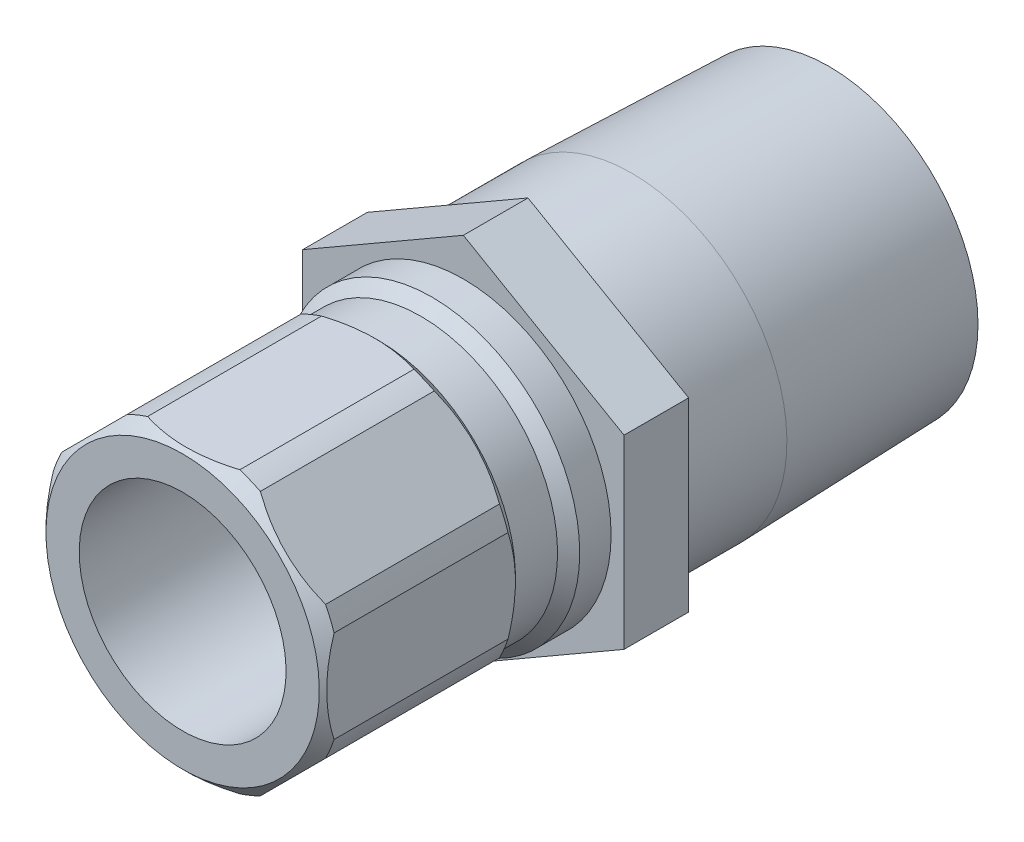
from build123d import *

# Parameters (mm, degrees)
SKETCH2_R           = 7.8994
BOSS_EXTRUDE1_DEPTH = 4.445
CUT_EXTRUDE1_START  = 5.8166
SKETCH3_OUTSIDE_W   = 35.26
SKETCH3_OUTSIDE_H   = 38.678
CUT_EXTRUDE1_DEPTH  = 25.468306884


with BuildPart() as part:
    # Sketch1 → Revolve1 (revolve)
    with BuildSketch(Plane(origin=(0, 0, 0), x_dir=(0, 0, -1), z_dir=(1, 0, 0))):
        Polygon((-19.304, 7.112), (-19.304, 9.398), (-18.542, 10.16), (-6.5786, 10.16), (-5.8166, 9.398), (-2.921, 9.398), (-2.159, 10.16), (0, 10.16), (0, 10.668), (11.5824, 10.668), (25.146, 10.244140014), (25.146, 7.8994), (-1.105331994, 7.8994), (-1.524, 7.112), align=None)
    revolve(axis=Axis((0, 0, 0), (0, 0, 1)))

    # Sketch2 → Boss-Extrude1 (add)
    with BuildSketch(Plane.XY):
        Polygon((-11.049, 6.379143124), (-11.049, -6.379143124), (0, -12.758286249), (11.049, -6.379143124), (11.049, 6.379143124), (0, 12.758286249), align=None)
        with Locations(Location((0, 0, 0), (0, 0, 90))):
            Circle(SKETCH2_R, mode=Mode.SUBTRACT)
    extrude(amount=-BOSS_EXTRUDE1_DEPTH)

    # Sketch3 outside → Cut-Extrude1 (cut, through all)
    with BuildSketch(Plane.XY.offset(CUT_EXTRUDE1_START)):
        Rectangle(SKETCH3_OUTSIDE_W, SKETCH3_OUTSIDE_H)
        Polygon((9.652, -3.997989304), (9.652, 3.997989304), (3.997989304, 9.652), (-3.997989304, 9.652), (-9.652, 3.997989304), (-9.652, -3.997989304), (-3.997989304, -9.652), (3.997989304, -9.652), align=None, mode=Mode.SUBTRACT)
    extrude(amount=CUT_EXTRUDE1_DEPTH, mode=Mode.SUBTRACT)


solid = part.part
